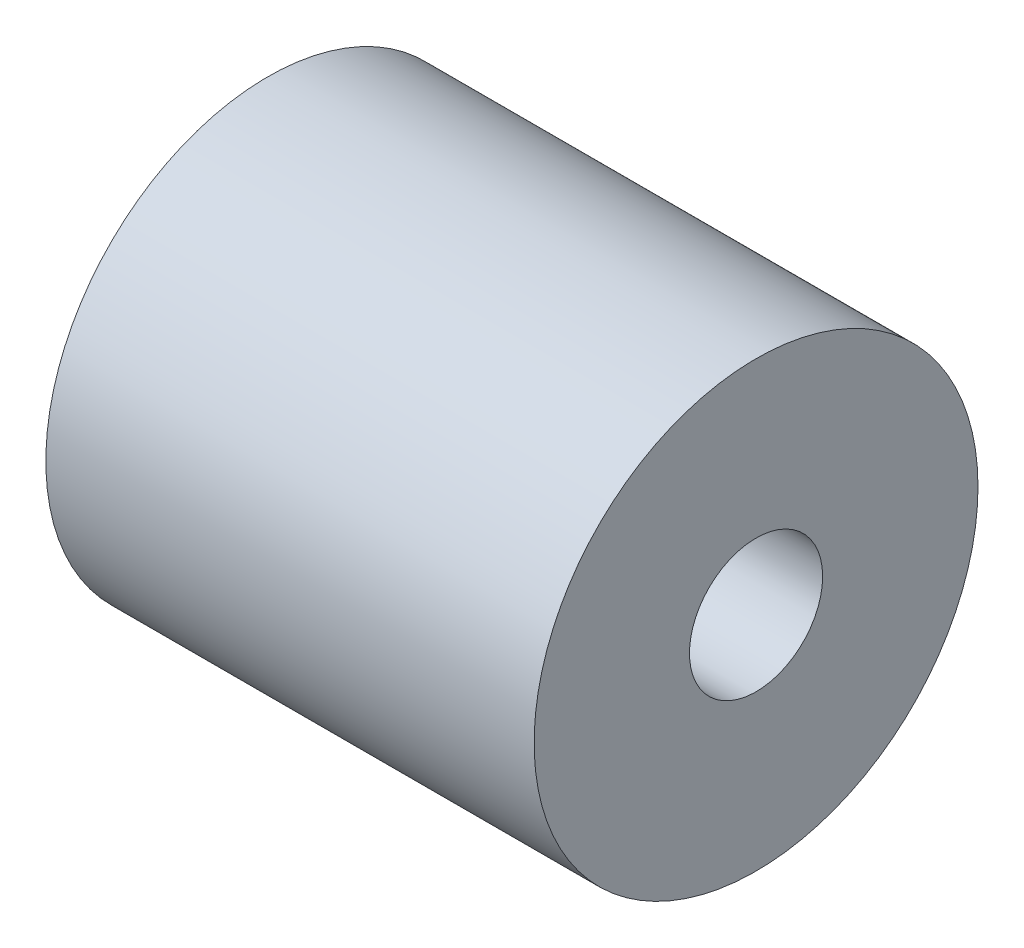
from build123d import *

# Parameters (mm, degrees)
SKETCH1_R           = 6.35
SKETCH1_R_2         = 1.905
BOSS_EXTRUDE1_DEPTH = 13.97


with BuildPart() as part:
    # Sketch1 → Boss-Extrude1 (new body)
    with BuildSketch(Plane(origin=(0, 0, 0), x_dir=(0, 0, -1), z_dir=(1, 0, 0))):
        Circle(SKETCH1_R)
        Circle(SKETCH1_R_2, mode=Mode.SUBTRACT)
    extrude(amount=BOSS_EXTRUDE1_DEPTH)


solid = part.part
